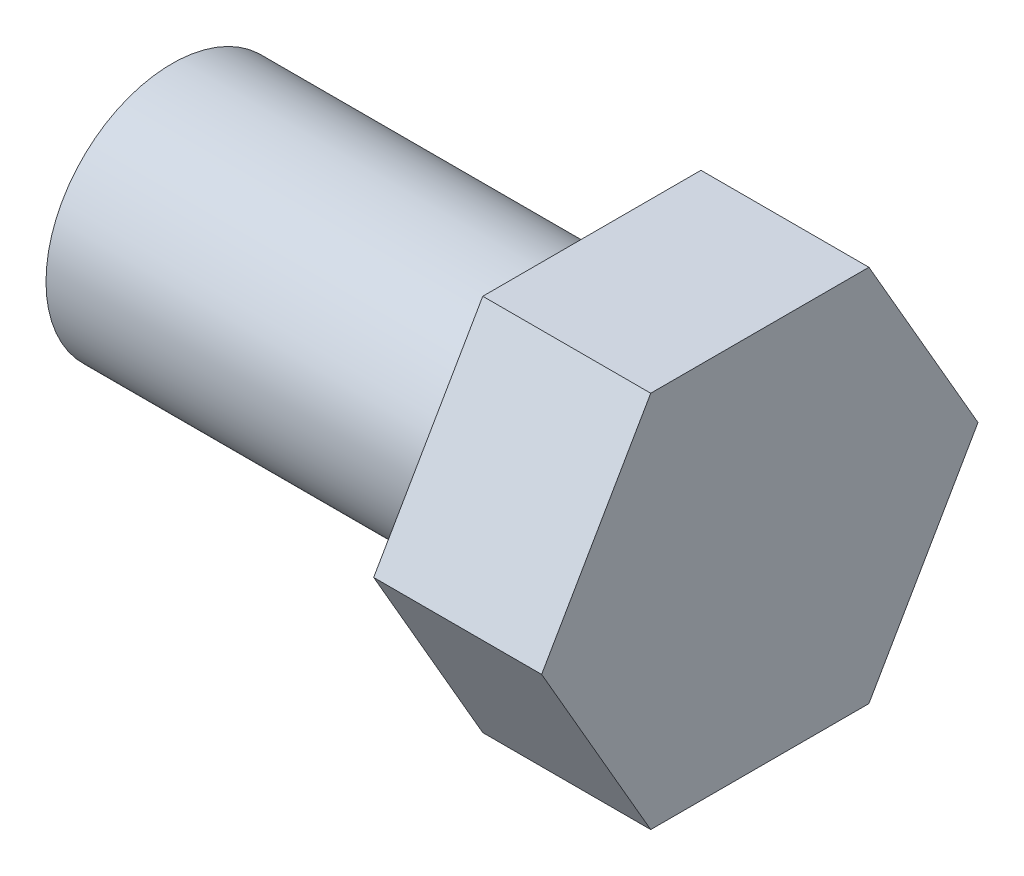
ISO-10303-21;
HEADER;
FILE_DESCRIPTION(('STEP AP214'),'2;1');
FILE_NAME('part.step','',(''),(''),'','','');
FILE_SCHEMA(('AUTOMOTIVE_DESIGN { 1 0 10303 214 1 1 1 1 }'));
ENDSEC;
DATA;
#1=APPLICATION_CONTEXT('core data for automotive mechanical design processes');
#2=APPLICATION_PROTOCOL_DEFINITION('international standard','automotive_design',2000,#1);
#3=PRODUCT_CONTEXT('',#1,'mechanical');
#4=PRODUCT('Part','Part','',(#3));
#5=PRODUCT_RELATED_PRODUCT_CATEGORY('part','',(#4));
#6=PRODUCT_DEFINITION_FORMATION('','',#4);
#7=PRODUCT_DEFINITION_CONTEXT('part definition',#1,'design');
#8=PRODUCT_DEFINITION('design','',#6,#7);
#9=PRODUCT_DEFINITION_SHAPE('','',#8);
#10=(LENGTH_UNIT() NAMED_UNIT(*) SI_UNIT(.MILLI.,.METRE.));
#11=(NAMED_UNIT(*) PLANE_ANGLE_UNIT() SI_UNIT($,.RADIAN.));
#12=(NAMED_UNIT(*) SI_UNIT($,.STERADIAN.) SOLID_ANGLE_UNIT());
#13=UNCERTAINTY_MEASURE_WITH_UNIT(LENGTH_MEASURE(1.E-05),#10,'distance_accuracy_value','');
#14=(GEOMETRIC_REPRESENTATION_CONTEXT(3) GLOBAL_UNCERTAINTY_ASSIGNED_CONTEXT((#13)) GLOBAL_UNIT_ASSIGNED_CONTEXT((#10,
#11,#12)) REPRESENTATION_CONTEXT('',''));
#15=CARTESIAN_POINT('',(0.,0.,0.));
#16=DIRECTION('',(0.,0.,1.));
#17=DIRECTION('',(1.,0.,0.));
#18=AXIS2_PLACEMENT_3D('',#15,#16,#17);
#19=CARTESIAN_POINT('',(0.,0.,0.));
#20=DIRECTION('',(1.,0.,0.));
#21=DIRECTION('',(0.,0.,-1.));
#22=AXIS2_PLACEMENT_3D('',#19,#20,#21);
#23=PLANE('',#22);
#24=DIRECTION('',(0.,0.866025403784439,0.5));
#25=VECTOR('',#24,1.);
#26=CARTESIAN_POINT('',(0.,0.,-8.24889197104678));
#27=LINE('',#26,#25);
#28=CARTESIAN_POINT('',(0.,0.,-8.24889197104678));
#29=VERTEX_POINT('',#28);
#30=CARTESIAN_POINT('',(0.,7.14375,-4.12444598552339));
#31=VERTEX_POINT('',#30);
#32=EDGE_CURVE('E118',#29,#31,#27,.T.);
#33=ORIENTED_EDGE('',*,*,#32,.F.);
#34=DIRECTION('',(0.,0.866025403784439,-0.5));
#35=VECTOR('',#34,1.);
#36=CARTESIAN_POINT('',(0.,-7.14375,-4.12444598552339));
#37=LINE('',#36,#35);
#38=CARTESIAN_POINT('',(0.,-7.14375,-4.12444598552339));
#39=VERTEX_POINT('',#38);
#40=EDGE_CURVE('E78',#39,#29,#37,.T.);
#41=ORIENTED_EDGE('',*,*,#40,.F.);
#42=DIRECTION('',(0.,0.,-1.));
#43=VECTOR('',#42,1.);
#44=CARTESIAN_POINT('',(0.,-7.14375,4.12444598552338));
#45=LINE('',#44,#43);
#46=CARTESIAN_POINT('',(0.,-7.14375,4.12444598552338));
#47=VERTEX_POINT('',#46);
#48=EDGE_CURVE('E72',#47,#39,#45,.T.);
#49=ORIENTED_EDGE('',*,*,#48,.F.);
#50=DIRECTION('',(0.,-0.866025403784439,-0.5));
#51=VECTOR('',#50,1.);
#52=CARTESIAN_POINT('',(0.,0.,8.24889197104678));
#53=LINE('',#52,#51);
#54=CARTESIAN_POINT('',(0.,0.,8.24889197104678));
#55=VERTEX_POINT('',#54);
#56=EDGE_CURVE('E108',#55,#47,#53,.T.);
#57=ORIENTED_EDGE('',*,*,#56,.F.);
#58=DIRECTION('',(0.,-0.866025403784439,0.5));
#59=VECTOR('',#58,1.);
#60=CARTESIAN_POINT('',(0.,7.14375,4.12444598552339));
#61=LINE('',#60,#59);
#62=CARTESIAN_POINT('',(0.,7.14375,4.12444598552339));
#63=VERTEX_POINT('',#62);
#64=EDGE_CURVE('E124',#63,#55,#61,.T.);
#65=ORIENTED_EDGE('',*,*,#64,.F.);
#66=DIRECTION('',(0.,0.,1.));
#67=VECTOR('',#66,1.);
#68=CARTESIAN_POINT('',(0.,7.14375,-4.12444598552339));
#69=LINE('',#68,#67);
#70=EDGE_CURVE('E121',#31,#63,#69,.T.);
#71=ORIENTED_EDGE('',*,*,#70,.F.);
#72=EDGE_LOOP('',(#33,#41,#49,#57,#65,#71));
#73=FACE_BOUND('',#72,.T.);
#74=CARTESIAN_POINT('',(0.,0.,0.));
#75=DIRECTION('',(1.,0.,0.));
#76=DIRECTION('',(0.,0.,-1.));
#77=AXIS2_PLACEMENT_3D('',#74,#75,#76);
#78=CIRCLE('',#77,4.7625);
#79=CARTESIAN_POINT('',(0.,0.,-4.7625));
#80=VERTEX_POINT('',#79);
#81=EDGE_CURVE('E11',#80,#80,#78,.F.);
#82=ORIENTED_EDGE('',*,*,#81,.F.);
#83=EDGE_LOOP('',(#82));
#84=FACE_BOUND('',#83,.T.);
#85=ADVANCED_FACE('F32',(#73,#84),#23,.F.);
#86=CARTESIAN_POINT('',(6.35,0.,-8.24889197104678));
#87=DIRECTION('',(0.,-0.5,0.866025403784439));
#88=DIRECTION('',(0.,-0.866025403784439,-0.5));
#89=AXIS2_PLACEMENT_3D('',#86,#87,#88);
#90=PLANE('',#89);
#91=ORIENTED_EDGE('',*,*,#32,.T.);
#92=DIRECTION('',(-1.,0.,0.));
#93=VECTOR('',#92,1.);
#94=CARTESIAN_POINT('',(6.35,7.14375,-4.12444598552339));
#95=LINE('',#94,#93);
#96=CARTESIAN_POINT('',(6.35,7.14375,-4.12444598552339));
#97=VERTEX_POINT('',#96);
#98=EDGE_CURVE('E41',#97,#31,#95,.T.);
#99=ORIENTED_EDGE('',*,*,#98,.F.);
#100=DIRECTION('',(0.,0.866025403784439,0.5));
#101=VECTOR('',#100,1.);
#102=CARTESIAN_POINT('',(6.35,0.,-8.24889197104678));
#103=LINE('',#102,#101);
#104=CARTESIAN_POINT('',(6.35,0.,-8.24889197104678));
#105=VERTEX_POINT('',#104);
#106=EDGE_CURVE('E129',#105,#97,#103,.T.);
#107=ORIENTED_EDGE('',*,*,#106,.F.);
#108=DIRECTION('',(-1.,0.,0.));
#109=VECTOR('',#108,1.);
#110=CARTESIAN_POINT('',(6.35,0.,-8.24889197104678));
#111=LINE('',#110,#109);
#112=EDGE_CURVE('E114',#105,#29,#111,.T.);
#113=ORIENTED_EDGE('',*,*,#112,.T.);
#114=EDGE_LOOP('',(#91,#99,#107,#113));
#115=FACE_BOUND('',#114,.T.);
#116=ADVANCED_FACE('F34',(#115),#90,.F.);
#117=CARTESIAN_POINT('',(6.35,7.14375,-4.12444598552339));
#118=DIRECTION('',(0.,-1.,0.));
#119=DIRECTION('',(0.,0.,-1.));
#120=AXIS2_PLACEMENT_3D('',#117,#118,#119);
#121=PLANE('',#120);
#122=ORIENTED_EDGE('',*,*,#70,.T.);
#123=DIRECTION('',(-1.,0.,0.));
#124=VECTOR('',#123,1.);
#125=CARTESIAN_POINT('',(6.35,7.14375,4.12444598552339));
#126=LINE('',#125,#124);
#127=CARTESIAN_POINT('',(6.35,7.14375,4.12444598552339));
#128=VERTEX_POINT('',#127);
#129=EDGE_CURVE('E133',#128,#63,#126,.T.);
#130=ORIENTED_EDGE('',*,*,#129,.F.);
#131=DIRECTION('',(0.,0.,1.));
#132=VECTOR('',#131,1.);
#133=CARTESIAN_POINT('',(6.35,7.14375,-4.12444598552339));
#134=LINE('',#133,#132);
#135=EDGE_CURVE('E87',#97,#128,#134,.T.);
#136=ORIENTED_EDGE('',*,*,#135,.F.);
#137=ORIENTED_EDGE('',*,*,#98,.T.);
#138=EDGE_LOOP('',(#122,#130,#136,#137));
#139=FACE_BOUND('',#138,.T.);
#140=ADVANCED_FACE('F136',(#139),#121,.F.);
#141=CARTESIAN_POINT('',(6.35,7.14375,4.12444598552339));
#142=DIRECTION('',(0.,-0.5,-0.866025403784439));
#143=DIRECTION('',(0.,0.866025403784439,-0.5));
#144=AXIS2_PLACEMENT_3D('',#141,#142,#143);
#145=PLANE('',#144);
#146=ORIENTED_EDGE('',*,*,#64,.T.);
#147=DIRECTION('',(-1.,0.,0.));
#148=VECTOR('',#147,1.);
#149=CARTESIAN_POINT('',(6.35,0.,8.24889197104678));
#150=LINE('',#149,#148);
#151=CARTESIAN_POINT('',(6.35,0.,8.24889197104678));
#152=VERTEX_POINT('',#151);
#153=EDGE_CURVE('E109',#152,#55,#150,.T.);
#154=ORIENTED_EDGE('',*,*,#153,.F.);
#155=DIRECTION('',(0.,-0.866025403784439,0.5));
#156=VECTOR('',#155,1.);
#157=CARTESIAN_POINT('',(6.35,7.14375,4.12444598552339));
#158=LINE('',#157,#156);
#159=EDGE_CURVE('E100',#128,#152,#158,.T.);
#160=ORIENTED_EDGE('',*,*,#159,.F.);
#161=ORIENTED_EDGE('',*,*,#129,.T.);
#162=EDGE_LOOP('',(#146,#154,#160,#161));
#163=FACE_BOUND('',#162,.T.);
#164=ADVANCED_FACE('F144',(#163),#145,.F.);
#165=CARTESIAN_POINT('',(6.35,0.,8.24889197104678));
#166=DIRECTION('',(0.,0.5,-0.866025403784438));
#167=DIRECTION('',(0.,0.866025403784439,0.5));
#168=AXIS2_PLACEMENT_3D('',#165,#166,#167);
#169=PLANE('',#168);
#170=ORIENTED_EDGE('',*,*,#56,.T.);
#171=DIRECTION('',(-1.,0.,0.));
#172=VECTOR('',#171,1.);
#173=CARTESIAN_POINT('',(6.35,-7.14375,4.12444598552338));
#174=LINE('',#173,#172);
#175=CARTESIAN_POINT('',(6.35,-7.14375,4.12444598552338));
#176=VERTEX_POINT('',#175);
#177=EDGE_CURVE('E105',#176,#47,#174,.T.);
#178=ORIENTED_EDGE('',*,*,#177,.F.);
#179=DIRECTION('',(0.,-0.866025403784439,-0.5));
#180=VECTOR('',#179,1.);
#181=CARTESIAN_POINT('',(6.35,0.,8.24889197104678));
#182=LINE('',#181,#180);
#183=EDGE_CURVE('E94',#152,#176,#182,.T.);
#184=ORIENTED_EDGE('',*,*,#183,.F.);
#185=ORIENTED_EDGE('',*,*,#153,.T.);
#186=EDGE_LOOP('',(#170,#178,#184,#185));
#187=FACE_BOUND('',#186,.T.);
#188=ADVANCED_FACE('F106',(#187),#169,.F.);
#189=CARTESIAN_POINT('',(6.35,-7.14375,4.12444598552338));
#190=DIRECTION('',(0.,1.,0.));
#191=DIRECTION('',(0.,0.,1.));
#192=AXIS2_PLACEMENT_3D('',#189,#190,#191);
#193=PLANE('',#192);
#194=ORIENTED_EDGE('',*,*,#48,.T.);
#195=DIRECTION('',(-1.,0.,0.));
#196=VECTOR('',#195,1.);
#197=CARTESIAN_POINT('',(6.35,-7.14375,-4.12444598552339));
#198=LINE('',#197,#196);
#199=CARTESIAN_POINT('',(6.35,-7.14375,-4.12444598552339));
#200=VERTEX_POINT('',#199);
#201=EDGE_CURVE('E110',#200,#39,#198,.T.);
#202=ORIENTED_EDGE('',*,*,#201,.F.);
#203=DIRECTION('',(0.,0.,-1.));
#204=VECTOR('',#203,1.);
#205=CARTESIAN_POINT('',(6.35,-7.14375,4.12444598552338));
#206=LINE('',#205,#204);
#207=EDGE_CURVE('E98',#176,#200,#206,.T.);
#208=ORIENTED_EDGE('',*,*,#207,.F.);
#209=ORIENTED_EDGE('',*,*,#177,.T.);
#210=EDGE_LOOP('',(#194,#202,#208,#209));
#211=FACE_BOUND('',#210,.T.);
#212=ADVANCED_FACE('F112',(#211),#193,.F.);
#213=CARTESIAN_POINT('',(6.35,-7.14375,-4.12444598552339));
#214=DIRECTION('',(0.,0.5,0.866025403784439));
#215=DIRECTION('',(0.,-0.866025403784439,0.5));
#216=AXIS2_PLACEMENT_3D('',#213,#214,#215);
#217=PLANE('',#216);
#218=ORIENTED_EDGE('',*,*,#40,.T.);
#219=ORIENTED_EDGE('',*,*,#112,.F.);
#220=DIRECTION('',(0.,0.866025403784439,-0.5));
#221=VECTOR('',#220,1.);
#222=CARTESIAN_POINT('',(6.35,-7.14375,-4.12444598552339));
#223=LINE('',#222,#221);
#224=EDGE_CURVE('E49',#200,#105,#223,.T.);
#225=ORIENTED_EDGE('',*,*,#224,.F.);
#226=ORIENTED_EDGE('',*,*,#201,.T.);
#227=EDGE_LOOP('',(#218,#219,#225,#226));
#228=FACE_BOUND('',#227,.T.);
#229=ADVANCED_FACE('F165',(#228),#217,.F.);
#230=CARTESIAN_POINT('',(6.35,0.,0.));
#231=DIRECTION('',(1.,0.,0.));
#232=DIRECTION('',(0.,0.,-1.));
#233=AXIS2_PLACEMENT_3D('',#230,#231,#232);
#234=PLANE('',#233);
#235=ORIENTED_EDGE('',*,*,#106,.T.);
#236=ORIENTED_EDGE('',*,*,#135,.T.);
#237=ORIENTED_EDGE('',*,*,#159,.T.);
#238=ORIENTED_EDGE('',*,*,#183,.T.);
#239=ORIENTED_EDGE('',*,*,#207,.T.);
#240=ORIENTED_EDGE('',*,*,#224,.T.);
#241=EDGE_LOOP('',(#235,#236,#237,#238,#239,#240));
#242=FACE_BOUND('',#241,.T.);
#243=ADVANCED_FACE('F96',(#242),#234,.T.);
#244=CARTESIAN_POINT('',(-15.875,0.,0.));
#245=DIRECTION('',(1.,0.,0.));
#246=DIRECTION('',(0.,0.,-1.));
#247=AXIS2_PLACEMENT_3D('',#244,#245,#246);
#248=CYLINDRICAL_SURFACE('',#247,4.7625);
#249=CARTESIAN_POINT('',(-15.875,0.,0.));
#250=DIRECTION('',(-1.,0.,0.));
#251=DIRECTION('',(0.,0.,1.));
#252=AXIS2_PLACEMENT_3D('',#249,#250,#251);
#253=CIRCLE('',#252,4.7625);
#254=CARTESIAN_POINT('',(-15.875,0.,4.7625));
#255=VERTEX_POINT('',#254);
#256=EDGE_CURVE('E122',#255,#255,#253,.T.);
#257=ORIENTED_EDGE('',*,*,#256,.F.);
#258=EDGE_LOOP('',(#257));
#259=FACE_BOUND('',#258,.T.);
#260=ORIENTED_EDGE('',*,*,#81,.T.);
#261=EDGE_LOOP('',(#260));
#262=FACE_BOUND('',#261,.T.);
#263=ADVANCED_FACE('F153',(#259,#262),#248,.T.);
#264=CARTESIAN_POINT('',(-15.875,0.,0.));
#265=DIRECTION('',(-1.,0.,0.));
#266=DIRECTION('',(0.,0.,1.));
#267=AXIS2_PLACEMENT_3D('',#264,#265,#266);
#268=PLANE('',#267);
#269=ORIENTED_EDGE('',*,*,#256,.T.);
#270=EDGE_LOOP('',(#269));
#271=FACE_BOUND('',#270,.T.);
#272=ADVANCED_FACE('F151',(#271),#268,.T.);
#273=CLOSED_SHELL('',(#85,#116,#140,#164,#188,#212,#229,#243,#263,#272));
#274=MANIFOLD_SOLID_BREP('B2',#273);
#275=ADVANCED_BREP_SHAPE_REPRESENTATION('',(#18,#274),#14);
#276=SHAPE_DEFINITION_REPRESENTATION(#9,#275);
ENDSEC;
END-ISO-10303-21;
